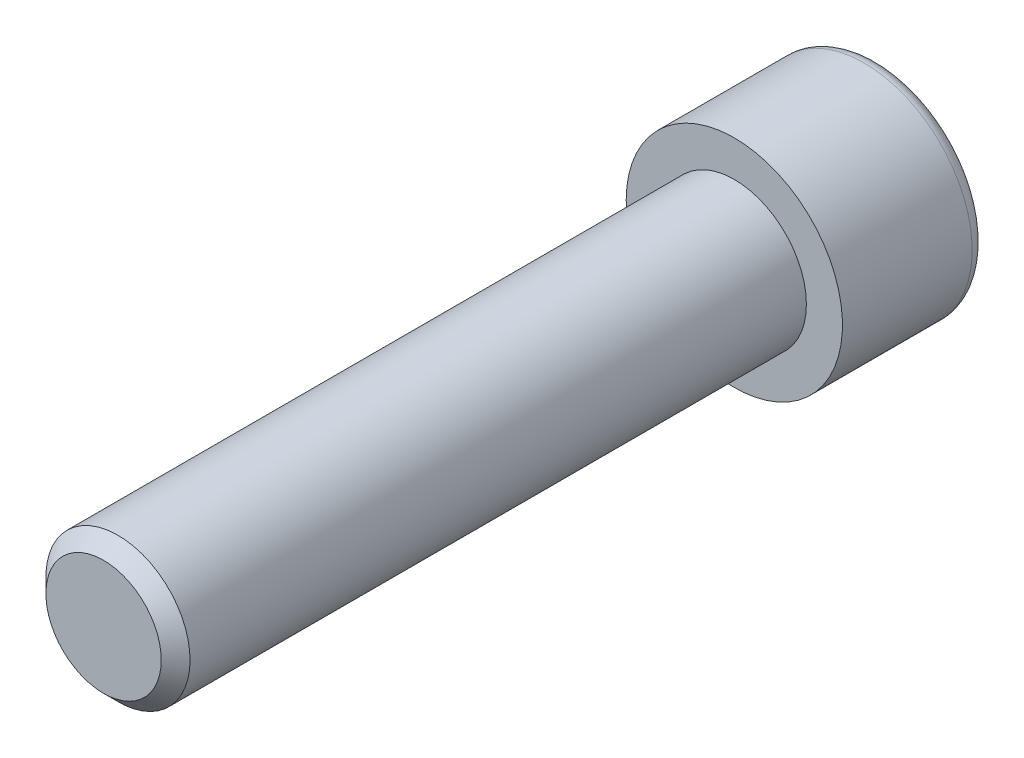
ISO-10303-21;
HEADER;
FILE_DESCRIPTION(('STEP AP214'),'2;1');
FILE_NAME('part.step','',(''),(''),'','','');
FILE_SCHEMA(('AUTOMOTIVE_DESIGN { 1 0 10303 214 1 1 1 1 }'));
ENDSEC;
DATA;
#1=APPLICATION_CONTEXT('core data for automotive mechanical design processes');
#2=APPLICATION_PROTOCOL_DEFINITION('international standard','automotive_design',2000,#1);
#3=PRODUCT_CONTEXT('',#1,'mechanical');
#4=PRODUCT('Part','Part','',(#3));
#5=PRODUCT_RELATED_PRODUCT_CATEGORY('part','',(#4));
#6=PRODUCT_DEFINITION_FORMATION('','',#4);
#7=PRODUCT_DEFINITION_CONTEXT('part definition',#1,'design');
#8=PRODUCT_DEFINITION('design','',#6,#7);
#9=PRODUCT_DEFINITION_SHAPE('','',#8);
#10=(LENGTH_UNIT() NAMED_UNIT(*) SI_UNIT(.MILLI.,.METRE.));
#11=(NAMED_UNIT(*) PLANE_ANGLE_UNIT() SI_UNIT($,.RADIAN.));
#12=(NAMED_UNIT(*) SI_UNIT($,.STERADIAN.) SOLID_ANGLE_UNIT());
#13=UNCERTAINTY_MEASURE_WITH_UNIT(LENGTH_MEASURE(1.E-05),#10,'distance_accuracy_value','');
#14=(GEOMETRIC_REPRESENTATION_CONTEXT(3) GLOBAL_UNCERTAINTY_ASSIGNED_CONTEXT((#13)) GLOBAL_UNIT_ASSIGNED_CONTEXT((#10,
#11,#12)) REPRESENTATION_CONTEXT('',''));
#15=CARTESIAN_POINT('',(0.,0.,0.));
#16=DIRECTION('',(0.,0.,1.));
#17=DIRECTION('',(1.,0.,0.));
#18=AXIS2_PLACEMENT_3D('',#15,#16,#17);
#19=CARTESIAN_POINT('',(0.,0.,-16.));
#20=DIRECTION('',(0.,0.,1.));
#21=DIRECTION('',(1.,0.,0.));
#22=AXIS2_PLACEMENT_3D('',#19,#20,#21);
#23=PLANE('',#22);
#24=CARTESIAN_POINT('',(0.,0.,-16.));
#25=DIRECTION('',(0.,0.,-1.));
#26=DIRECTION('',(-1.,0.,0.));
#27=AXIS2_PLACEMENT_3D('',#24,#25,#26);
#28=CIRCLE('',#27,10.4);
#29=CARTESIAN_POINT('',(-10.4,0.,-16.));
#30=VERTEX_POINT('',#29);
#31=EDGE_CURVE('E458',#30,#30,#28,.T.);
#32=ORIENTED_EDGE('',*,*,#31,.T.);
#33=EDGE_LOOP('',(#32));
#34=FACE_BOUND('',#33,.T.);
#35=DIRECTION('',(-0.86602540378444,0.499999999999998,0.));
#36=VECTOR('',#35,1.);
#37=CARTESIAN_POINT('',(0.,8.08290376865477,-16.));
#38=LINE('',#37,#36);
#39=CARTESIAN_POINT('',(7.,4.04145188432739,-16.));
#40=VERTEX_POINT('',#39);
#41=CARTESIAN_POINT('',(0.,8.08290376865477,-16.));
#42=VERTEX_POINT('',#41);
#43=EDGE_CURVE('E362',#40,#42,#38,.T.);
#44=ORIENTED_EDGE('',*,*,#43,.T.);
#45=DIRECTION('',(-0.866025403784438,-0.500000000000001,0.));
#46=VECTOR('',#45,1.);
#47=CARTESIAN_POINT('',(0.,8.08290376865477,-16.));
#48=LINE('',#47,#46);
#49=CARTESIAN_POINT('',(-7.,4.04145188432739,-16.));
#50=VERTEX_POINT('',#49);
#51=EDGE_CURVE('E402',#42,#50,#48,.T.);
#52=ORIENTED_EDGE('',*,*,#51,.T.);
#53=DIRECTION('',(0.,-1.,0.));
#54=VECTOR('',#53,1.);
#55=CARTESIAN_POINT('',(-7.,-4.04145188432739,-16.));
#56=LINE('',#55,#54);
#57=CARTESIAN_POINT('',(-7.,-4.04145188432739,-16.));
#58=VERTEX_POINT('',#57);
#59=EDGE_CURVE('E410',#50,#58,#56,.T.);
#60=ORIENTED_EDGE('',*,*,#59,.T.);
#61=DIRECTION('',(0.866025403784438,-0.500000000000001,0.));
#62=VECTOR('',#61,1.);
#63=CARTESIAN_POINT('',(0.,-8.08290376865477,-16.));
#64=LINE('',#63,#62);
#65=CARTESIAN_POINT('',(0.,-8.08290376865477,-16.));
#66=VERTEX_POINT('',#65);
#67=EDGE_CURVE('E428',#58,#66,#64,.T.);
#68=ORIENTED_EDGE('',*,*,#67,.T.);
#69=DIRECTION('',(0.86602540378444,0.499999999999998,0.));
#70=VECTOR('',#69,1.);
#71=CARTESIAN_POINT('',(0.,-8.08290376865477,-16.));
#72=LINE('',#71,#70);
#73=CARTESIAN_POINT('',(7.,-4.04145188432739,-16.));
#74=VERTEX_POINT('',#73);
#75=EDGE_CURVE('E431',#66,#74,#72,.T.);
#76=ORIENTED_EDGE('',*,*,#75,.T.);
#77=DIRECTION('',(0.,1.,0.));
#78=VECTOR('',#77,1.);
#79=CARTESIAN_POINT('',(7.,-4.04145188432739,-16.));
#80=LINE('',#79,#78);
#81=EDGE_CURVE('E421',#74,#40,#80,.T.);
#82=ORIENTED_EDGE('',*,*,#81,.T.);
#83=EDGE_LOOP('',(#44,#52,#60,#68,#76,#82));
#84=FACE_BOUND('',#83,.T.);
#85=ADVANCED_FACE('F348',(#34,#84),#23,.F.);
#86=CARTESIAN_POINT('',(0.,0.,-14.4));
#87=DIRECTION('',(0.,0.,-1.));
#88=DIRECTION('',(-1.,0.,0.));
#89=AXIS2_PLACEMENT_3D('',#86,#87,#88);
#90=TOROIDAL_SURFACE('',#89,10.4,1.6);
#91=ORIENTED_EDGE('',*,*,#31,.F.);
#92=EDGE_LOOP('',(#91));
#93=FACE_BOUND('',#92,.T.);
#94=CARTESIAN_POINT('',(0.,0.,-14.4));
#95=DIRECTION('',(0.,0.,-1.));
#96=DIRECTION('',(-1.,0.,0.));
#97=AXIS2_PLACEMENT_3D('',#94,#95,#96);
#98=CIRCLE('',#97,12.);
#99=CARTESIAN_POINT('',(-12.,0.,-14.4));
#100=VERTEX_POINT('',#99);
#101=EDGE_CURVE('E455',#100,#100,#98,.T.);
#102=ORIENTED_EDGE('',*,*,#101,.T.);
#103=EDGE_LOOP('',(#102));
#104=FACE_BOUND('',#103,.T.);
#105=ADVANCED_FACE('F477',(#93,#104),#90,.T.);
#106=CARTESIAN_POINT('',(0.,0.,0.));
#107=DIRECTION('',(0.,0.,-1.));
#108=DIRECTION('',(-1.,0.,0.));
#109=AXIS2_PLACEMENT_3D('',#106,#107,#108);
#110=CYLINDRICAL_SURFACE('',#109,12.);
#111=ORIENTED_EDGE('',*,*,#101,.F.);
#112=EDGE_LOOP('',(#111));
#113=FACE_BOUND('',#112,.T.);
#114=CARTESIAN_POINT('',(0.,0.,0.));
#115=DIRECTION('',(0.,0.,-1.));
#116=DIRECTION('',(-1.,0.,0.));
#117=AXIS2_PLACEMENT_3D('',#114,#115,#116);
#118=CIRCLE('',#117,12.);
#119=CARTESIAN_POINT('',(-12.,0.,0.));
#120=VERTEX_POINT('',#119);
#121=EDGE_CURVE('E416',#120,#120,#118,.T.);
#122=ORIENTED_EDGE('',*,*,#121,.T.);
#123=EDGE_LOOP('',(#122));
#124=FACE_BOUND('',#123,.T.);
#125=ADVANCED_FACE('F482',(#113,#124),#110,.T.);
#126=CARTESIAN_POINT('',(0.,0.,0.));
#127=DIRECTION('',(0.,0.,-1.));
#128=DIRECTION('',(-1.,0.,0.));
#129=AXIS2_PLACEMENT_3D('',#126,#127,#128);
#130=PLANE('',#129);
#131=CARTESIAN_POINT('',(0.,0.,0.));
#132=DIRECTION('',(0.,0.,1.));
#133=DIRECTION('',(1.,0.,0.));
#134=AXIS2_PLACEMENT_3D('',#131,#132,#133);
#135=CIRCLE('',#134,8.);
#136=CARTESIAN_POINT('',(8.,0.,0.));
#137=VERTEX_POINT('',#136);
#138=EDGE_CURVE('E422',#137,#137,#135,.T.);
#139=ORIENTED_EDGE('',*,*,#138,.F.);
#140=EDGE_LOOP('',(#139));
#141=FACE_BOUND('',#140,.T.);
#142=ORIENTED_EDGE('',*,*,#121,.F.);
#143=EDGE_LOOP('',(#142));
#144=FACE_BOUND('',#143,.T.);
#145=ADVANCED_FACE('F490',(#141,#144),#130,.F.);
#146=CARTESIAN_POINT('',(0.,8.08290376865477,-6.));
#147=DIRECTION('',(-0.499999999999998,-0.86602540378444,0.));
#148=DIRECTION('',(0.86602540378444,-0.499999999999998,0.));
#149=AXIS2_PLACEMENT_3D('',#146,#147,#148);
#150=PLANE('',#149);
#151=ORIENTED_EDGE('',*,*,#43,.F.);
#152=DIRECTION('',(0.,0.,-1.));
#153=VECTOR('',#152,1.);
#154=CARTESIAN_POINT('',(7.,4.04145188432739,-6.));
#155=LINE('',#154,#153);
#156=CARTESIAN_POINT('',(7.,4.04145188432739,-6.));
#157=VERTEX_POINT('',#156);
#158=EDGE_CURVE('E444',#157,#40,#155,.T.);
#159=ORIENTED_EDGE('',*,*,#158,.F.);
#160=DIRECTION('',(-0.86602540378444,0.499999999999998,0.));
#161=VECTOR('',#160,1.);
#162=CARTESIAN_POINT('',(0.,8.08290376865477,-6.));
#163=LINE('',#162,#161);
#164=CARTESIAN_POINT('',(0.,8.08290376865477,-6.));
#165=VERTEX_POINT('',#164);
#166=EDGE_CURVE('E415',#157,#165,#163,.T.);
#167=ORIENTED_EDGE('',*,*,#166,.T.);
#168=DIRECTION('',(0.,0.,-1.));
#169=VECTOR('',#168,1.);
#170=CARTESIAN_POINT('',(0.,8.08290376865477,-6.));
#171=LINE('',#170,#169);
#172=EDGE_CURVE('E404',#165,#42,#171,.T.);
#173=ORIENTED_EDGE('',*,*,#172,.T.);
#174=EDGE_LOOP('',(#151,#159,#167,#173));
#175=FACE_BOUND('',#174,.T.);
#176=ADVANCED_FACE('F413',(#175),#150,.T.);
#177=CARTESIAN_POINT('',(0.,8.08290376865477,-6.));
#178=DIRECTION('',(0.500000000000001,-0.866025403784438,0.));
#179=DIRECTION('',(0.866025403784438,0.500000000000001,0.));
#180=AXIS2_PLACEMENT_3D('',#177,#178,#179);
#181=PLANE('',#180);
#182=ORIENTED_EDGE('',*,*,#51,.F.);
#183=ORIENTED_EDGE('',*,*,#172,.F.);
#184=DIRECTION('',(-0.866025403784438,-0.500000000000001,0.));
#185=VECTOR('',#184,1.);
#186=CARTESIAN_POINT('',(0.,8.08290376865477,-6.));
#187=LINE('',#186,#185);
#188=CARTESIAN_POINT('',(-7.,4.04145188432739,-6.));
#189=VERTEX_POINT('',#188);
#190=EDGE_CURVE('E435',#165,#189,#187,.T.);
#191=ORIENTED_EDGE('',*,*,#190,.T.);
#192=DIRECTION('',(0.,0.,-1.));
#193=VECTOR('',#192,1.);
#194=CARTESIAN_POINT('',(-7.,4.04145188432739,-6.));
#195=LINE('',#194,#193);
#196=EDGE_CURVE('E406',#189,#50,#195,.T.);
#197=ORIENTED_EDGE('',*,*,#196,.T.);
#198=EDGE_LOOP('',(#182,#183,#191,#197));
#199=FACE_BOUND('',#198,.T.);
#200=ADVANCED_FACE('F403',(#199),#181,.T.);
#201=CARTESIAN_POINT('',(-7.,-4.04145188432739,-6.));
#202=DIRECTION('',(1.,0.,0.));
#203=DIRECTION('',(0.,0.,-1.));
#204=AXIS2_PLACEMENT_3D('',#201,#202,#203);
#205=PLANE('',#204);
#206=ORIENTED_EDGE('',*,*,#59,.F.);
#207=ORIENTED_EDGE('',*,*,#196,.F.);
#208=DIRECTION('',(0.,-1.,0.));
#209=VECTOR('',#208,1.);
#210=CARTESIAN_POINT('',(-7.,-4.04145188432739,-6.));
#211=LINE('',#210,#209);
#212=CARTESIAN_POINT('',(-7.,-4.04145188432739,-6.));
#213=VERTEX_POINT('',#212);
#214=EDGE_CURVE('E437',#189,#213,#211,.T.);
#215=ORIENTED_EDGE('',*,*,#214,.T.);
#216=DIRECTION('',(0.,0.,-1.));
#217=VECTOR('',#216,1.);
#218=CARTESIAN_POINT('',(-7.,-4.04145188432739,-6.));
#219=LINE('',#218,#217);
#220=EDGE_CURVE('E450',#213,#58,#219,.T.);
#221=ORIENTED_EDGE('',*,*,#220,.T.);
#222=EDGE_LOOP('',(#206,#207,#215,#221));
#223=FACE_BOUND('',#222,.T.);
#224=ADVANCED_FACE('F505',(#223),#205,.T.);
#225=CARTESIAN_POINT('',(0.,-8.08290376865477,-6.));
#226=DIRECTION('',(0.500000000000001,0.866025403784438,0.));
#227=DIRECTION('',(-0.866025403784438,0.500000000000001,0.));
#228=AXIS2_PLACEMENT_3D('',#225,#226,#227);
#229=PLANE('',#228);
#230=ORIENTED_EDGE('',*,*,#67,.F.);
#231=ORIENTED_EDGE('',*,*,#220,.F.);
#232=DIRECTION('',(0.866025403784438,-0.500000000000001,0.));
#233=VECTOR('',#232,1.);
#234=CARTESIAN_POINT('',(0.,-8.08290376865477,-6.));
#235=LINE('',#234,#233);
#236=CARTESIAN_POINT('',(0.,-8.08290376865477,-6.));
#237=VERTEX_POINT('',#236);
#238=EDGE_CURVE('E439',#213,#237,#235,.T.);
#239=ORIENTED_EDGE('',*,*,#238,.T.);
#240=DIRECTION('',(0.,0.,-1.));
#241=VECTOR('',#240,1.);
#242=CARTESIAN_POINT('',(0.,-8.08290376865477,-6.));
#243=LINE('',#242,#241);
#244=EDGE_CURVE('E448',#237,#66,#243,.T.);
#245=ORIENTED_EDGE('',*,*,#244,.T.);
#246=EDGE_LOOP('',(#230,#231,#239,#245));
#247=FACE_BOUND('',#246,.T.);
#248=ADVANCED_FACE('F508',(#247),#229,.T.);
#249=CARTESIAN_POINT('',(0.,-8.08290376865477,-6.));
#250=DIRECTION('',(-0.499999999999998,0.86602540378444,0.));
#251=DIRECTION('',(-0.86602540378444,-0.499999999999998,0.));
#252=AXIS2_PLACEMENT_3D('',#249,#250,#251);
#253=PLANE('',#252);
#254=ORIENTED_EDGE('',*,*,#75,.F.);
#255=ORIENTED_EDGE('',*,*,#244,.F.);
#256=DIRECTION('',(0.86602540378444,0.499999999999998,0.));
#257=VECTOR('',#256,1.);
#258=CARTESIAN_POINT('',(0.,-8.08290376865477,-6.));
#259=LINE('',#258,#257);
#260=CARTESIAN_POINT('',(7.,-4.04145188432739,-6.));
#261=VERTEX_POINT('',#260);
#262=EDGE_CURVE('E441',#237,#261,#259,.T.);
#263=ORIENTED_EDGE('',*,*,#262,.T.);
#264=DIRECTION('',(0.,0.,-1.));
#265=VECTOR('',#264,1.);
#266=CARTESIAN_POINT('',(7.,-4.04145188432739,-6.));
#267=LINE('',#266,#265);
#268=EDGE_CURVE('E446',#261,#74,#267,.T.);
#269=ORIENTED_EDGE('',*,*,#268,.T.);
#270=EDGE_LOOP('',(#254,#255,#263,#269));
#271=FACE_BOUND('',#270,.T.);
#272=ADVANCED_FACE('F512',(#271),#253,.T.);
#273=CARTESIAN_POINT('',(7.,-4.04145188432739,-6.));
#274=DIRECTION('',(-1.,0.,0.));
#275=DIRECTION('',(0.,0.,1.));
#276=AXIS2_PLACEMENT_3D('',#273,#274,#275);
#277=PLANE('',#276);
#278=ORIENTED_EDGE('',*,*,#81,.F.);
#279=ORIENTED_EDGE('',*,*,#268,.F.);
#280=DIRECTION('',(0.,1.,0.));
#281=VECTOR('',#280,1.);
#282=CARTESIAN_POINT('',(7.,-4.04145188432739,-6.));
#283=LINE('',#282,#281);
#284=EDGE_CURVE('E369',#261,#157,#283,.T.);
#285=ORIENTED_EDGE('',*,*,#284,.T.);
#286=ORIENTED_EDGE('',*,*,#158,.T.);
#287=EDGE_LOOP('',(#278,#279,#285,#286));
#288=FACE_BOUND('',#287,.T.);
#289=ADVANCED_FACE('F516',(#288),#277,.T.);
#290=CARTESIAN_POINT('',(7.,4.04145188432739,-6.));
#291=DIRECTION('',(0.,0.,1.));
#292=DIRECTION('',(1.,0.,0.));
#293=AXIS2_PLACEMENT_3D('',#290,#291,#292);
#294=PLANE('',#293);
#295=ORIENTED_EDGE('',*,*,#166,.F.);
#296=ORIENTED_EDGE('',*,*,#284,.F.);
#297=ORIENTED_EDGE('',*,*,#262,.F.);
#298=ORIENTED_EDGE('',*,*,#238,.F.);
#299=ORIENTED_EDGE('',*,*,#214,.F.);
#300=ORIENTED_EDGE('',*,*,#190,.F.);
#301=EDGE_LOOP('',(#295,#296,#297,#298,#299,#300));
#302=FACE_BOUND('',#301,.T.);
#303=ADVANCED_FACE('F520',(#302),#294,.F.);
#304=CARTESIAN_POINT('',(0.,0.,70.));
#305=DIRECTION('',(0.,0.,1.));
#306=DIRECTION('',(1.,0.,0.));
#307=AXIS2_PLACEMENT_3D('',#304,#305,#306);
#308=PLANE('',#307);
#309=CARTESIAN_POINT('',(0.,0.,70.));
#310=DIRECTION('',(0.,0.,1.));
#311=DIRECTION('',(1.,0.,0.));
#312=AXIS2_PLACEMENT_3D('',#309,#310,#311);
#313=CIRCLE('',#312,6.39999999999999);
#314=CARTESIAN_POINT('',(6.4,0.,70.));
#315=VERTEX_POINT('',#314);
#316=EDGE_CURVE('E355',#315,#315,#313,.T.);
#317=ORIENTED_EDGE('',*,*,#316,.T.);
#318=EDGE_LOOP('',(#317));
#319=FACE_BOUND('',#318,.T.);
#320=ADVANCED_FACE('F463',(#319),#308,.T.);
#321=CARTESIAN_POINT('',(0.,0.,0.));
#322=DIRECTION('',(0.,0.,1.));
#323=DIRECTION('',(1.,0.,0.));
#324=AXIS2_PLACEMENT_3D('',#321,#322,#323);
#325=CYLINDRICAL_SURFACE('',#324,8.);
#326=CARTESIAN_POINT('',(0.,0.,68.4));
#327=DIRECTION('',(0.,0.,1.));
#328=DIRECTION('',(1.,0.,0.));
#329=AXIS2_PLACEMENT_3D('',#326,#327,#328);
#330=CIRCLE('',#329,8.);
#331=CARTESIAN_POINT('',(8.00000000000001,0.,68.4));
#332=VERTEX_POINT('',#331);
#333=EDGE_CURVE('E11',#332,#332,#330,.F.);
#334=ORIENTED_EDGE('',*,*,#333,.T.);
#335=EDGE_LOOP('',(#334));
#336=FACE_BOUND('',#335,.T.);
#337=ORIENTED_EDGE('',*,*,#138,.T.);
#338=EDGE_LOOP('',(#337));
#339=FACE_BOUND('',#338,.T.);
#340=ADVANCED_FACE('F467',(#336,#339),#325,.T.);
#341=CARTESIAN_POINT('',(0.,0.,70.));
#342=DIRECTION('',(0.,0.,-1.));
#343=DIRECTION('',(-1.,0.,0.));
#344=AXIS2_PLACEMENT_3D('',#341,#342,#343);
#345=CONICAL_SURFACE('',#344,6.39999999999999,0.785398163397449);
#346=ORIENTED_EDGE('',*,*,#333,.F.);
#347=EDGE_LOOP('',(#346));
#348=FACE_BOUND('',#347,.T.);
#349=ORIENTED_EDGE('',*,*,#316,.F.);
#350=EDGE_LOOP('',(#349));
#351=FACE_BOUND('',#350,.T.);
#352=ADVANCED_FACE('F465',(#348,#351),#345,.T.);
#353=CLOSED_SHELL('',(#85,#105,#125,#145,#176,#200,#224,#248,#272,#289,#303,#320,#340,#352));
#354=MANIFOLD_SOLID_BREP('B2',#353);
#355=ADVANCED_BREP_SHAPE_REPRESENTATION('',(#18,#354),#14);
#356=SHAPE_DEFINITION_REPRESENTATION(#9,#355);
ENDSEC;
END-ISO-10303-21;
